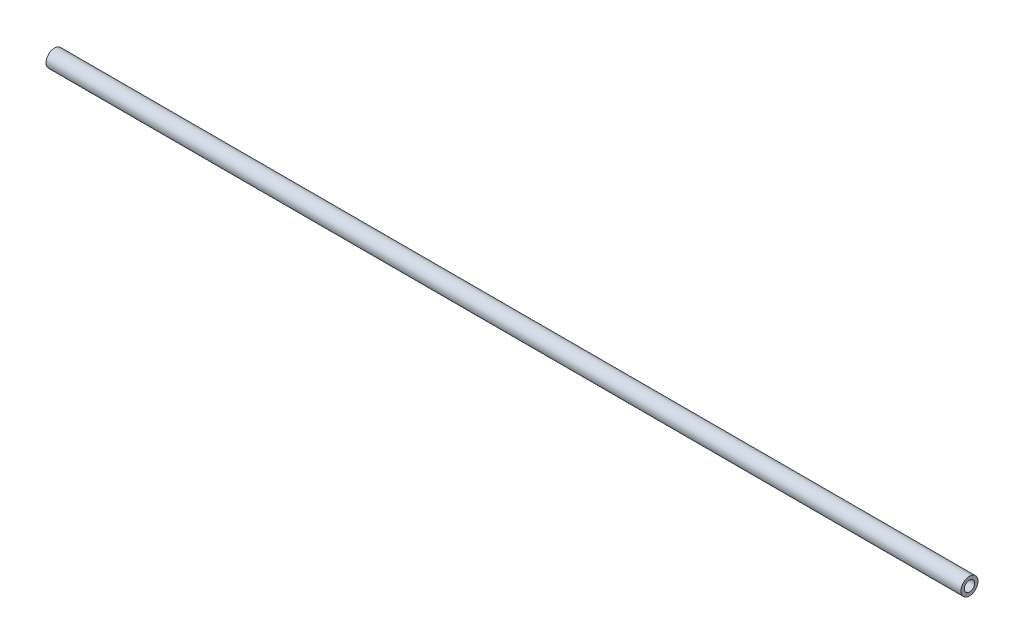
from build123d import *

# Parameters (mm, degrees)
SKETCH1_W      = 533.4
SKETCH1_H      = 1.5875
SKETCH2_W      = 233.808690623
SKETCH2_H      = 135.161877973
EXTRUDE1_DEPTH = 5.159375


with BuildPart() as part:
    # Sketch1 → Revolve1 (revolve)
    with BuildSketch(Plane.XY, mode=Mode.PRIVATE) as revolve1_sk:
        with Locations((-266.7, 3.175)):
            Rectangle(SKETCH1_W, SKETCH1_H)
    revolve(revolve1_sk.sketch.rotate(Axis((0, 0, 0), (1, 0, 0)), 90), axis=Axis((0, 0, 0), (1, 0, 0)))

    # Sketch2 → Extrude1 (cut, symmetric)
    with BuildSketch(Plane.XY):
        with Locations((-542.354345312, 8.082770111)):
            Rectangle(SKETCH2_W, SKETCH2_H)
    extrude(amount=EXTRUDE1_DEPTH, both=True, mode=Mode.SUBTRACT)


solid = part.part
